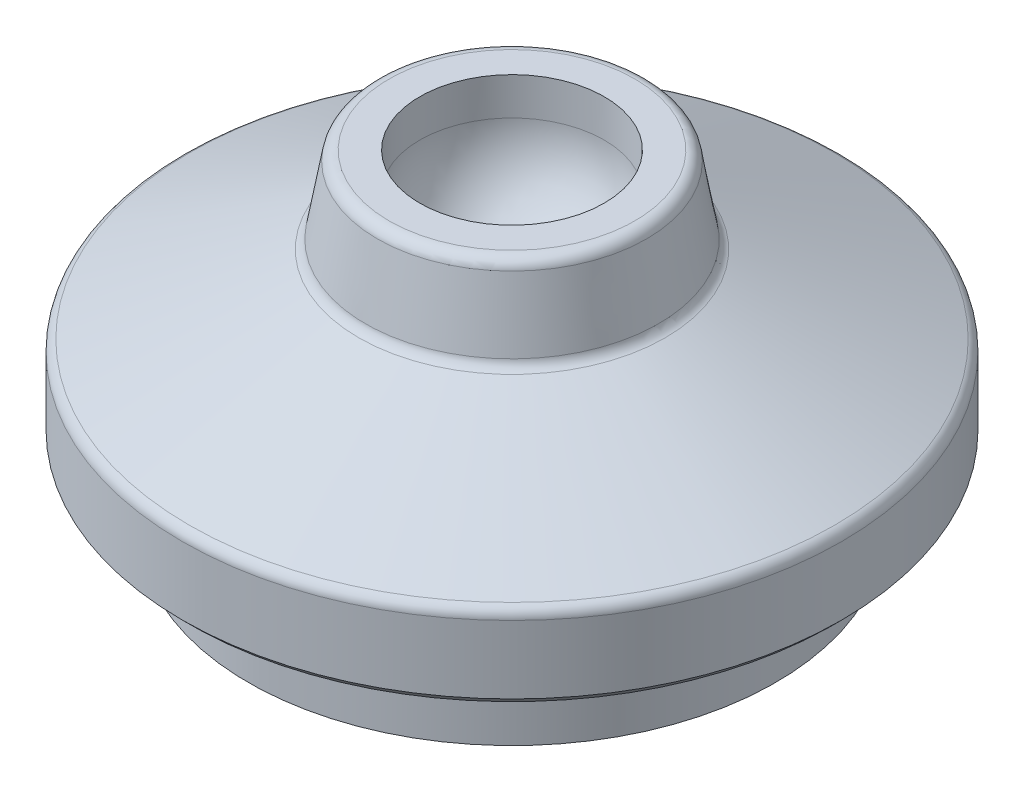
ISO-10303-21;
HEADER;
FILE_DESCRIPTION(('STEP AP214'),'2;1');
FILE_NAME('part.step','',(''),(''),'','','');
FILE_SCHEMA(('AUTOMOTIVE_DESIGN { 1 0 10303 214 1 1 1 1 }'));
ENDSEC;
DATA;
#1=APPLICATION_CONTEXT('core data for automotive mechanical design processes');
#2=APPLICATION_PROTOCOL_DEFINITION('international standard','automotive_design',2000,#1);
#3=PRODUCT_CONTEXT('',#1,'mechanical');
#4=PRODUCT('Part','Part','',(#3));
#5=PRODUCT_RELATED_PRODUCT_CATEGORY('part','',(#4));
#6=PRODUCT_DEFINITION_FORMATION('','',#4);
#7=PRODUCT_DEFINITION_CONTEXT('part definition',#1,'design');
#8=PRODUCT_DEFINITION('design','',#6,#7);
#9=PRODUCT_DEFINITION_SHAPE('','',#8);
#10=(LENGTH_UNIT() NAMED_UNIT(*) SI_UNIT(.MILLI.,.METRE.));
#11=(NAMED_UNIT(*) PLANE_ANGLE_UNIT() SI_UNIT($,.RADIAN.));
#12=(NAMED_UNIT(*) SI_UNIT($,.STERADIAN.) SOLID_ANGLE_UNIT());
#13=UNCERTAINTY_MEASURE_WITH_UNIT(LENGTH_MEASURE(1.E-05),#10,'distance_accuracy_value','');
#14=(GEOMETRIC_REPRESENTATION_CONTEXT(3) GLOBAL_UNCERTAINTY_ASSIGNED_CONTEXT((#13)) GLOBAL_UNIT_ASSIGNED_CONTEXT((#10,
#11,#12)) REPRESENTATION_CONTEXT('',''));
#15=CARTESIAN_POINT('',(0.,0.,0.));
#16=DIRECTION('',(0.,0.,1.));
#17=DIRECTION('',(1.,0.,0.));
#18=AXIS2_PLACEMENT_3D('',#15,#16,#17);
#19=CARTESIAN_POINT('',(6.39355143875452,19.,0.));
#20=DIRECTION('',(0.,-1.,0.));
#21=DIRECTION('',(0.,0.,-1.));
#22=AXIS2_PLACEMENT_3D('',#19,#20,#21);
#23=PLANE('',#22);
#24=CARTESIAN_POINT('',(0.,19.,0.));
#25=DIRECTION('',(0.,-1.,0.));
#26=DIRECTION('',(1.,0.,0.));
#27=AXIS2_PLACEMENT_3D('',#24,#25,#26);
#28=CIRCLE('',#27,7.);
#29=CARTESIAN_POINT('',(7.,19.,0.));
#30=VERTEX_POINT('',#29);
#31=EDGE_CURVE('E62',#30,#30,#28,.T.);
#32=ORIENTED_EDGE('',*,*,#31,.T.);
#33=EDGE_LOOP('',(#32));
#34=FACE_BOUND('',#33,.T.);
#35=CARTESIAN_POINT('',(0.,19.,0.));
#36=DIRECTION('',(0.,-1.,0.));
#37=DIRECTION('',(0.,0.,-1.));
#38=AXIS2_PLACEMENT_3D('',#35,#36,#37);
#39=CIRCLE('',#38,9.32807278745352);
#40=CARTESIAN_POINT('',(0.,19.,-9.32807278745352));
#41=VERTEX_POINT('',#40);
#42=EDGE_CURVE('E9',#41,#41,#39,.F.);
#43=ORIENTED_EDGE('',*,*,#42,.T.);
#44=EDGE_LOOP('',(#43));
#45=FACE_BOUND('',#44,.T.);
#46=ADVANCED_FACE('F15',(#34,#45),#23,.F.);
#47=CARTESIAN_POINT('',(0.,18.2562833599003,0.));
#48=DIRECTION('',(0.,-1.,0.));
#49=DIRECTION('',(0.,0.,-1.));
#50=AXIS2_PLACEMENT_3D('',#47,#48,#49);
#51=CONICAL_SURFACE('',#50,10.2143997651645,0.174532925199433);
#52=CARTESIAN_POINT('',(0.,13.1314843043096,0.));
#53=DIRECTION('',(0.,-1.,0.));
#54=DIRECTION('',(0.,0.,-1.));
#55=AXIS2_PLACEMENT_3D('',#52,#53,#54);
#56=CIRCLE('',#55,11.1180401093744);
#57=CARTESIAN_POINT('',(0.,13.1314843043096,-11.1180401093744));
#58=VERTEX_POINT('',#57);
#59=EDGE_CURVE('E26',#58,#58,#56,.F.);
#60=ORIENTED_EDGE('',*,*,#59,.T.);
#61=EDGE_LOOP('',(#60));
#62=FACE_BOUND('',#61,.T.);
#63=CARTESIAN_POINT('',(0.,18.2562833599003,0.));
#64=DIRECTION('',(0.,1.,0.));
#65=DIRECTION('',(0.,0.,1.));
#66=AXIS2_PLACEMENT_3D('',#63,#64,#65);
#67=CIRCLE('',#66,10.2143997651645);
#68=CARTESIAN_POINT('',(0.,18.2562833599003,10.2143997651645));
#69=VERTEX_POINT('',#68);
#70=EDGE_CURVE('E30',#69,#69,#67,.F.);
#71=ORIENTED_EDGE('',*,*,#70,.T.);
#72=EDGE_LOOP('',(#71));
#73=FACE_BOUND('',#72,.T.);
#74=ADVANCED_FACE('F84',(#62,#73),#51,.T.);
#75=CARTESIAN_POINT('',(0.,12.4697965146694,0.));
#76=DIRECTION('',(0.,-1.,0.));
#77=DIRECTION('',(0.,0.,-1.));
#78=AXIS2_PLACEMENT_3D('',#75,#76,#77);
#79=CONICAL_SURFACE('',#78,11.6289696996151,1.14053512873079);
#80=CARTESIAN_POINT('',(0.,12.4697965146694,0.));
#81=DIRECTION('',(0.,-1.,0.));
#82=DIRECTION('',(0.,0.,-1.));
#83=AXIS2_PLACEMENT_3D('',#80,#81,#82);
#84=CIRCLE('',#83,11.6289696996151);
#85=CARTESIAN_POINT('',(0.,12.4697965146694,-11.6289696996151));
#86=VERTEX_POINT('',#85);
#87=EDGE_CURVE('E35',#86,#86,#84,.T.);
#88=ORIENTED_EDGE('',*,*,#87,.T.);
#89=EDGE_LOOP('',(#88));
#90=FACE_BOUND('',#89,.T.);
#91=CARTESIAN_POINT('',(0.,6.5740929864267,0.));
#92=DIRECTION('',(0.,1.,0.));
#93=DIRECTION('',(0.,0.,1.));
#94=AXIS2_PLACEMENT_3D('',#91,#92,#93);
#95=CIRCLE('',#94,24.4753973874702);
#96=CARTESIAN_POINT('',(0.,6.5740929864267,24.4753973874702));
#97=VERTEX_POINT('',#96);
#98=EDGE_CURVE('E38',#97,#97,#95,.T.);
#99=ORIENTED_EDGE('',*,*,#98,.T.);
#100=EDGE_LOOP('',(#99));
#101=FACE_BOUND('',#100,.T.);
#102=ADVANCED_FACE('F89',(#90,#101),#79,.T.);
#103=CARTESIAN_POINT('',(0.,0.,0.));
#104=DIRECTION('',(0.,1.,0.));
#105=DIRECTION('',(0.,0.,1.));
#106=AXIS2_PLACEMENT_3D('',#103,#104,#105);
#107=CYLINDRICAL_SURFACE('',#106,25.);
#108=CARTESIAN_POINT('',(0.,5.75612183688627,0.));
#109=DIRECTION('',(0.,1.,0.));
#110=DIRECTION('',(0.,0.,1.));
#111=AXIS2_PLACEMENT_3D('',#108,#109,#110);
#112=CIRCLE('',#111,25.);
#113=CARTESIAN_POINT('',(0.,5.75612183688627,25.));
#114=VERTEX_POINT('',#113);
#115=EDGE_CURVE('E22',#114,#114,#112,.F.);
#116=ORIENTED_EDGE('',*,*,#115,.T.);
#117=EDGE_LOOP('',(#116));
#118=FACE_BOUND('',#117,.T.);
#119=CARTESIAN_POINT('',(0.,0.600000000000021,0.));
#120=DIRECTION('',(0.,-1.,0.));
#121=DIRECTION('',(0.,0.,-1.));
#122=AXIS2_PLACEMENT_3D('',#119,#120,#121);
#123=CIRCLE('',#122,25.);
#124=CARTESIAN_POINT('',(0.,0.600000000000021,-25.));
#125=VERTEX_POINT('',#124);
#126=EDGE_CURVE('E41',#125,#125,#123,.F.);
#127=ORIENTED_EDGE('',*,*,#126,.T.);
#128=EDGE_LOOP('',(#127));
#129=FACE_BOUND('',#128,.T.);
#130=ADVANCED_FACE('F95',(#118,#129),#107,.T.);
#131=CARTESIAN_POINT('',(0.,0.,0.));
#132=DIRECTION('',(0.,-1.,0.));
#133=DIRECTION('',(0.,0.,-1.));
#134=AXIS2_PLACEMENT_3D('',#131,#132,#133);
#135=PLANE('',#134);
#136=CARTESIAN_POINT('',(0.,0.,0.));
#137=DIRECTION('',(0.,-1.,0.));
#138=DIRECTION('',(0.,0.,-1.));
#139=AXIS2_PLACEMENT_3D('',#136,#137,#138);
#140=CIRCLE('',#139,24.4);
#141=CARTESIAN_POINT('',(0.,0.,-24.4));
#142=VERTEX_POINT('',#141);
#143=EDGE_CURVE('E44',#142,#142,#140,.T.);
#144=ORIENTED_EDGE('',*,*,#143,.T.);
#145=EDGE_LOOP('',(#144));
#146=FACE_BOUND('',#145,.T.);
#147=CARTESIAN_POINT('',(0.,0.,0.));
#148=DIRECTION('',(0.,-1.,0.));
#149=DIRECTION('',(0.,0.,-1.));
#150=AXIS2_PLACEMENT_3D('',#147,#148,#149);
#151=CIRCLE('',#150,20.);
#152=CARTESIAN_POINT('',(0.,0.,-20.));
#153=VERTEX_POINT('',#152);
#154=EDGE_CURVE('E47',#153,#153,#151,.T.);
#155=ORIENTED_EDGE('',*,*,#154,.F.);
#156=EDGE_LOOP('',(#155));
#157=FACE_BOUND('',#156,.T.);
#158=ADVANCED_FACE('F99',(#146,#157),#135,.T.);
#159=CARTESIAN_POINT('',(0.,-6.,0.));
#160=DIRECTION('',(0.,1.,0.));
#161=DIRECTION('',(0.,0.,1.));
#162=AXIS2_PLACEMENT_3D('',#159,#160,#161);
#163=CYLINDRICAL_SURFACE('',#162,20.);
#164=CARTESIAN_POINT('',(0.,-6.,0.));
#165=DIRECTION('',(0.,-1.,0.));
#166=DIRECTION('',(0.,0.,-1.));
#167=AXIS2_PLACEMENT_3D('',#164,#165,#166);
#168=CIRCLE('',#167,20.);
#169=CARTESIAN_POINT('',(0.,-6.,-20.));
#170=VERTEX_POINT('',#169);
#171=EDGE_CURVE('E50',#170,#170,#168,.T.);
#172=ORIENTED_EDGE('',*,*,#171,.F.);
#173=EDGE_LOOP('',(#172));
#174=FACE_BOUND('',#173,.T.);
#175=ORIENTED_EDGE('',*,*,#154,.T.);
#176=EDGE_LOOP('',(#175));
#177=FACE_BOUND('',#176,.T.);
#178=ADVANCED_FACE('F102',(#174,#177),#163,.T.);
#179=CARTESIAN_POINT('',(0.,-6.,0.));
#180=DIRECTION('',(0.,-1.,0.));
#181=DIRECTION('',(0.,0.,-1.));
#182=AXIS2_PLACEMENT_3D('',#179,#180,#181);
#183=PLANE('',#182);
#184=CARTESIAN_POINT('',(0.,-6.,0.));
#185=DIRECTION('',(0.,-1.,0.));
#186=DIRECTION('',(0.,0.,-1.));
#187=AXIS2_PLACEMENT_3D('',#184,#185,#186);
#188=CIRCLE('',#187,9.2);
#189=CARTESIAN_POINT('',(0.,-6.,-9.2));
#190=VERTEX_POINT('',#189);
#191=EDGE_CURVE('E54',#190,#190,#188,.T.);
#192=ORIENTED_EDGE('',*,*,#191,.F.);
#193=EDGE_LOOP('',(#192));
#194=FACE_BOUND('',#193,.T.);
#195=ORIENTED_EDGE('',*,*,#171,.T.);
#196=EDGE_LOOP('',(#195));
#197=FACE_BOUND('',#196,.T.);
#198=ADVANCED_FACE('F106',(#194,#197),#183,.T.);
#199=CARTESIAN_POINT('',(0.,0.,0.));
#200=DIRECTION('',(0.,1.,0.));
#201=DIRECTION('',(0.,0.,1.));
#202=AXIS2_PLACEMENT_3D('',#199,#200,#201);
#203=CONICAL_SURFACE('',#202,24.4,0.785398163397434);
#204=ORIENTED_EDGE('',*,*,#126,.F.);
#205=EDGE_LOOP('',(#204));
#206=FACE_BOUND('',#205,.T.);
#207=ORIENTED_EDGE('',*,*,#143,.F.);
#208=EDGE_LOOP('',(#207));
#209=FACE_BOUND('',#208,.T.);
#210=ADVANCED_FACE('F110',(#206,#209),#203,.T.);
#211=CARTESIAN_POINT('',(0.,13.2877676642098,0.));
#212=DIRECTION('',(0.,-1.,0.));
#213=DIRECTION('',(0.,0.,-1.));
#214=AXIS2_PLACEMENT_3D('',#211,#212,#213);
#215=TOROIDAL_SURFACE('',#214,12.0043670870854,0.9);
#216=ORIENTED_EDGE('',*,*,#59,.F.);
#217=EDGE_LOOP('',(#216));
#218=FACE_BOUND('',#217,.T.);
#219=ORIENTED_EDGE('',*,*,#87,.F.);
#220=EDGE_LOOP('',(#219));
#221=FACE_BOUND('',#220,.T.);
#222=ADVANCED_FACE('F211',(#218,#221),#215,.F.);
#223=CARTESIAN_POINT('',(0.,5.75612183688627,0.));
#224=DIRECTION('',(0.,1.,0.));
#225=DIRECTION('',(0.,0.,1.));
#226=AXIS2_PLACEMENT_3D('',#223,#224,#225);
#227=TOROIDAL_SURFACE('',#226,24.1,0.9);
#228=ORIENTED_EDGE('',*,*,#98,.F.);
#229=EDGE_LOOP('',(#228));
#230=FACE_BOUND('',#229,.T.);
#231=ORIENTED_EDGE('',*,*,#115,.F.);
#232=EDGE_LOOP('',(#231));
#233=FACE_BOUND('',#232,.T.);
#234=ADVANCED_FACE('F204',(#230,#233),#227,.T.);
#235=CARTESIAN_POINT('',(0.,18.1,0.));
#236=DIRECTION('',(0.,-1.,0.));
#237=DIRECTION('',(0.,0.,-1.));
#238=AXIS2_PLACEMENT_3D('',#235,#236,#237);
#239=TOROIDAL_SURFACE('',#238,9.32807278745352,0.9);
#240=ORIENTED_EDGE('',*,*,#70,.F.);
#241=EDGE_LOOP('',(#240));
#242=FACE_BOUND('',#241,.T.);
#243=ORIENTED_EDGE('',*,*,#42,.F.);
#244=EDGE_LOOP('',(#243));
#245=FACE_BOUND('',#244,.T.);
#246=ADVANCED_FACE('F17',(#242,#245),#239,.T.);
#247=CARTESIAN_POINT('',(0.,0.,0.));
#248=DIRECTION('',(0.,-1.,0.));
#249=DIRECTION('',(0.,0.,-1.));
#250=AXIS2_PLACEMENT_3D('',#247,#248,#249);
#251=CYLINDRICAL_SURFACE('',#250,9.2);
#252=CARTESIAN_POINT('',(0.,0.,0.));
#253=DIRECTION('',(0.,-1.,0.));
#254=DIRECTION('',(0.,0.,-1.));
#255=AXIS2_PLACEMENT_3D('',#252,#253,#254);
#256=CIRCLE('',#255,9.2);
#257=CARTESIAN_POINT('',(0.,0.,-9.2));
#258=VERTEX_POINT('',#257);
#259=EDGE_CURVE('E53',#258,#258,#256,.T.);
#260=ORIENTED_EDGE('',*,*,#259,.F.);
#261=EDGE_LOOP('',(#260));
#262=FACE_BOUND('',#261,.T.);
#263=ORIENTED_EDGE('',*,*,#191,.T.);
#264=EDGE_LOOP('',(#263));
#265=FACE_BOUND('',#264,.T.);
#266=ADVANCED_FACE('F112',(#262,#265),#251,.F.);
#267=CARTESIAN_POINT('',(0.,0.,0.));
#268=DIRECTION('',(0.,-1.,0.));
#269=DIRECTION('',(0.,0.,-1.));
#270=AXIS2_PLACEMENT_3D('',#267,#268,#269);
#271=PLANE('',#270);
#272=ORIENTED_EDGE('',*,*,#259,.T.);
#273=EDGE_LOOP('',(#272));
#274=FACE_BOUND('',#273,.T.);
#275=ADVANCED_FACE('F71',(#274),#271,.T.);
#276=CARTESIAN_POINT('',(0.,9.15,0.));
#277=DIRECTION('',(0.,-1.,0.));
#278=DIRECTION('',(1.,0.,0.));
#279=AXIS2_PLACEMENT_3D('',#276,#277,#278);
#280=CYLINDRICAL_SURFACE('',#279,7.);
#281=ORIENTED_EDGE('',*,*,#31,.F.);
#282=EDGE_LOOP('',(#281));
#283=FACE_BOUND('',#282,.T.);
#284=CARTESIAN_POINT('',(0.,16.15,0.));
#285=DIRECTION('',(0.,-1.,0.));
#286=DIRECTION('',(1.,0.,0.));
#287=AXIS2_PLACEMENT_3D('',#284,#285,#286);
#288=CIRCLE('',#287,7.);
#289=CARTESIAN_POINT('',(7.,16.15,0.));
#290=VERTEX_POINT('',#289);
#291=EDGE_CURVE('E57',#290,#290,#288,.T.);
#292=ORIENTED_EDGE('',*,*,#291,.T.);
#293=EDGE_LOOP('',(#292));
#294=FACE_BOUND('',#293,.T.);
#295=ADVANCED_FACE('F67',(#283,#294),#280,.F.);
#296=CARTESIAN_POINT('',(0.,16.15,0.));
#297=DIRECTION('',(0.,-1.,0.));
#298=DIRECTION('',(-1.,0.,0.));
#299=AXIS2_PLACEMENT_3D('',#296,#297,#298);
#300=SPHERICAL_SURFACE('',#299,7.);
#301=ORIENTED_EDGE('',*,*,#291,.F.);
#302=EDGE_LOOP('',(#301));
#303=FACE_BOUND('',#302,.T.);
#304=ADVANCED_FACE('F70',(#303),#300,.F.);
#305=CLOSED_SHELL('',(#46,#74,#102,#130,#158,#178,#198,#210,#222,#234,#246,#266,#275,#295,#304));
#306=MANIFOLD_SOLID_BREP('B1',#305);
#307=ADVANCED_BREP_SHAPE_REPRESENTATION('',(#18,#306),#14);
#308=SHAPE_DEFINITION_REPRESENTATION(#9,#307);
ENDSEC;
END-ISO-10303-21;
